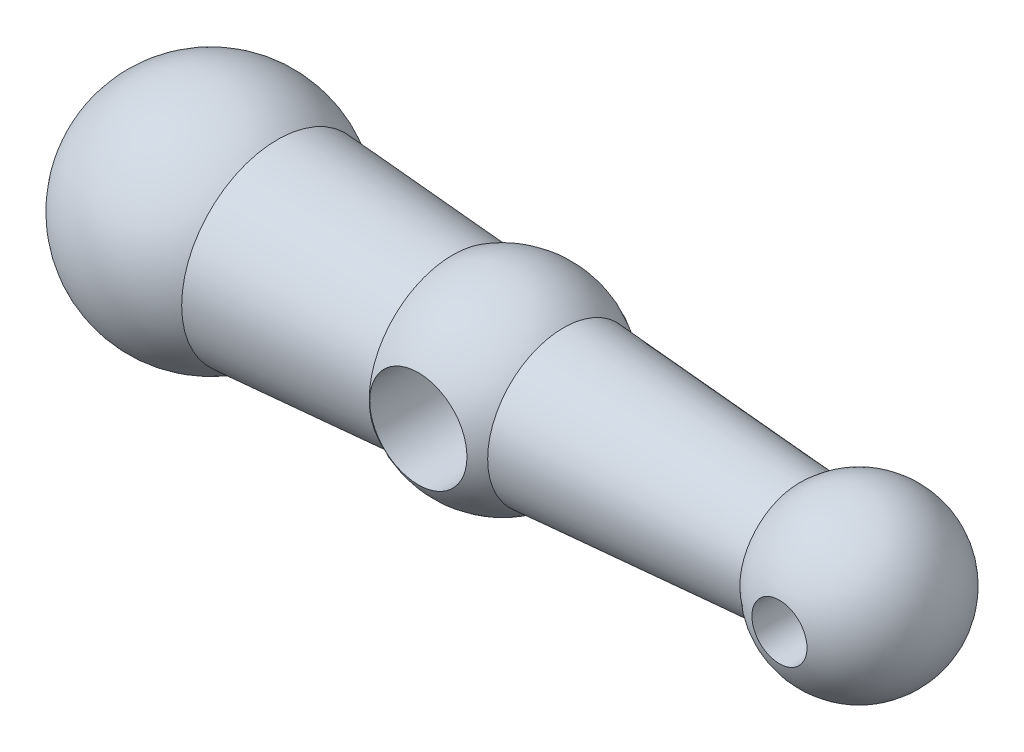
ISO-10303-21;
HEADER;
FILE_DESCRIPTION(('STEP AP214'),'2;1');
FILE_NAME('part.step','',(''),(''),'','','');
FILE_SCHEMA(('AUTOMOTIVE_DESIGN { 1 0 10303 214 1 1 1 1 }'));
ENDSEC;
DATA;
#1=APPLICATION_CONTEXT('core data for automotive mechanical design processes');
#2=APPLICATION_PROTOCOL_DEFINITION('international standard','automotive_design',2000,#1);
#3=PRODUCT_CONTEXT('',#1,'mechanical');
#4=PRODUCT('Part','Part','',(#3));
#5=PRODUCT_RELATED_PRODUCT_CATEGORY('part','',(#4));
#6=PRODUCT_DEFINITION_FORMATION('','',#4);
#7=PRODUCT_DEFINITION_CONTEXT('part definition',#1,'design');
#8=PRODUCT_DEFINITION('design','',#6,#7);
#9=PRODUCT_DEFINITION_SHAPE('','',#8);
#10=(LENGTH_UNIT() NAMED_UNIT(*) SI_UNIT(.MILLI.,.METRE.));
#11=(NAMED_UNIT(*) PLANE_ANGLE_UNIT() SI_UNIT($,.RADIAN.));
#12=(NAMED_UNIT(*) SI_UNIT($,.STERADIAN.) SOLID_ANGLE_UNIT());
#13=UNCERTAINTY_MEASURE_WITH_UNIT(LENGTH_MEASURE(1.E-05),#10,'distance_accuracy_value','');
#14=(GEOMETRIC_REPRESENTATION_CONTEXT(3) GLOBAL_UNCERTAINTY_ASSIGNED_CONTEXT((#13)) GLOBAL_UNIT_ASSIGNED_CONTEXT((#10,
#11,#12)) REPRESENTATION_CONTEXT('',''));
#15=CARTESIAN_POINT('',(0.,0.,0.));
#16=DIRECTION('',(0.,0.,1.));
#17=DIRECTION('',(1.,0.,0.));
#18=AXIS2_PLACEMENT_3D('',#15,#16,#17);
#19=CARTESIAN_POINT('',(50.,0.,0.));
#20=DIRECTION('',(-1.,0.,0.));
#21=DIRECTION('',(0.,0.,1.));
#22=AXIS2_PLACEMENT_3D('',#19,#20,#21);
#23=CONICAL_SURFACE('',#22,8.50365940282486,0.0698131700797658);
#24=CARTESIAN_POINT('',(4.39589792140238,0.,0.));
#25=DIRECTION('',(-1.,0.,0.));
#26=DIRECTION('',(0.,0.,1.));
#27=AXIS2_PLACEMENT_3D('',#24,#25,#26);
#28=CIRCLE('',#27,11.6926088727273);
#29=CARTESIAN_POINT('',(4.39589792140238,0.,11.6926088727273));
#30=VERTEX_POINT('',#29);
#31=EDGE_CURVE('E47',#30,#30,#28,.F.);
#32=ORIENTED_EDGE('',*,*,#31,.T.);
#33=EDGE_LOOP('',(#32));
#34=FACE_BOUND('',#33,.T.);
#35=CARTESIAN_POINT('',(40.7648662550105,0.,0.));
#36=DIRECTION('',(1.,0.,0.));
#37=DIRECTION('',(0.,0.,-1.));
#38=AXIS2_PLACEMENT_3D('',#35,#36,#37);
#39=CIRCLE('',#38,9.14944286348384);
#40=CARTESIAN_POINT('',(40.7648662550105,0.,-9.14944286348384));
#41=VERTEX_POINT('',#40);
#42=EDGE_CURVE('E11',#41,#41,#39,.T.);
#43=ORIENTED_EDGE('',*,*,#42,.F.);
#44=EDGE_LOOP('',(#43));
#45=FACE_BOUND('',#44,.T.);
#46=ADVANCED_FACE('F39',(#34,#45),#23,.T.);
#47=CARTESIAN_POINT('',(-5.,0.,0.));
#48=DIRECTION('',(0.,1.,0.));
#49=DIRECTION('',(1.,0.,0.));
#50=AXIS2_PLACEMENT_3D('',#47,#48,#49);
#51=SPHERICAL_SURFACE('',#50,15.);
#52=CARTESIAN_POINT('',(-5.,0.,12.9903810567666));
#53=DIRECTION('',(0.,0.,-1.));
#54=DIRECTION('',(-1.,0.,0.));
#55=AXIS2_PLACEMENT_3D('',#52,#53,#54);
#56=CIRCLE('',#55,7.5);
#57=CARTESIAN_POINT('',(-12.5,0.,12.9903810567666));
#58=VERTEX_POINT('',#57);
#59=EDGE_CURVE('E68',#58,#58,#56,.T.);
#60=ORIENTED_EDGE('',*,*,#59,.T.);
#61=EDGE_LOOP('',(#60));
#62=FACE_BOUND('',#61,.T.);
#63=CARTESIAN_POINT('',(-5.,0.,-12.9903810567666));
#64=DIRECTION('',(0.,0.,1.));
#65=DIRECTION('',(1.,0.,0.));
#66=AXIS2_PLACEMENT_3D('',#63,#64,#65);
#67=CIRCLE('',#66,7.5);
#68=CARTESIAN_POINT('',(2.5,0.,-12.9903810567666));
#69=VERTEX_POINT('',#68);
#70=EDGE_CURVE('E62',#69,#69,#67,.T.);
#71=ORIENTED_EDGE('',*,*,#70,.T.);
#72=EDGE_LOOP('',(#71));
#73=FACE_BOUND('',#72,.T.);
#74=CARTESIAN_POINT('',(-12.6771610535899,0.,0.));
#75=DIRECTION('',(1.,0.,0.));
#76=DIRECTION('',(0.,0.,-1.));
#77=AXIS2_PLACEMENT_3D('',#74,#75,#76);
#78=CIRCLE('',#77,12.8864734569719);
#79=CARTESIAN_POINT('',(-12.6771610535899,0.,-12.8864734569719));
#80=VERTEX_POINT('',#79);
#81=EDGE_CURVE('E67',#80,#80,#78,.T.);
#82=ORIENTED_EDGE('',*,*,#81,.T.);
#83=EDGE_LOOP('',(#82));
#84=FACE_BOUND('',#83,.T.);
#85=ORIENTED_EDGE('',*,*,#31,.F.);
#86=EDGE_LOOP('',(#85));
#87=FACE_BOUND('',#86,.T.);
#88=ADVANCED_FACE('F77',(#62,#73,#84,#87),#51,.T.);
#89=CARTESIAN_POINT('',(-5.,0.,0.));
#90=DIRECTION('',(-1.,0.,0.));
#91=DIRECTION('',(0.,0.,1.));
#92=AXIS2_PLACEMENT_3D('',#89,#90,#91);
#93=CONICAL_SURFACE('',#92,12.3496340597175,0.0698131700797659);
#94=CARTESIAN_POINT('',(-39.7228500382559,0.,0.));
#95=DIRECTION('',(-1.,0.,0.));
#96=DIRECTION('',(0.,0.,1.));
#97=AXIS2_PLACEMENT_3D('',#94,#95,#96);
#98=CIRCLE('',#97,14.7776922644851);
#99=CARTESIAN_POINT('',(-39.7228500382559,0.,14.7776922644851));
#100=VERTEX_POINT('',#99);
#101=EDGE_CURVE('E64',#100,#100,#98,.F.);
#102=ORIENTED_EDGE('',*,*,#101,.T.);
#103=EDGE_LOOP('',(#102));
#104=FACE_BOUND('',#103,.T.);
#105=ORIENTED_EDGE('',*,*,#81,.F.);
#106=EDGE_LOOP('',(#105));
#107=FACE_BOUND('',#106,.T.);
#108=ADVANCED_FACE('F99',(#104,#107),#93,.T.);
#109=CARTESIAN_POINT('',(-50.,0.,0.));
#110=DIRECTION('',(0.,1.,0.));
#111=DIRECTION('',(1.,0.,0.));
#112=AXIS2_PLACEMENT_3D('',#109,#110,#111);
#113=SPHERICAL_SURFACE('',#112,18.);
#114=CARTESIAN_POINT('',(-50.,0.,0.));
#115=DIRECTION('',(-1.,0.,0.));
#116=DIRECTION('',(0.,0.,1.));
#117=AXIS2_PLACEMENT_3D('',#114,#115,#116);
#118=SPHERICAL_SURFACE('',#117,18.);
#119=ORIENTED_EDGE('',*,*,#101,.F.);
#120=EDGE_LOOP('',(#119));
#121=FACE_BOUND('',#120,.T.);
#122=ADVANCED_FACE('F41',(#121),#118,.T.);
#123=CARTESIAN_POINT('',(50.,0.,0.));
#124=DIRECTION('',(0.,1.,0.));
#125=DIRECTION('',(1.,0.,0.));
#126=AXIS2_PLACEMENT_3D('',#123,#124,#125);
#127=SPHERICAL_SURFACE('',#126,13.);
#128=CARTESIAN_POINT('',(50.,0.,12.2856623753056));
#129=DIRECTION('',(0.,0.,-1.));
#130=DIRECTION('',(-1.,0.,0.));
#131=AXIS2_PLACEMENT_3D('',#128,#129,#130);
#132=CIRCLE('',#131,4.24999999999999);
#133=CARTESIAN_POINT('',(45.75,0.,12.2856623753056));
#134=VERTEX_POINT('',#133);
#135=EDGE_CURVE('E43',#134,#134,#132,.T.);
#136=ORIENTED_EDGE('',*,*,#135,.T.);
#137=EDGE_LOOP('',(#136));
#138=FACE_BOUND('',#137,.T.);
#139=ORIENTED_EDGE('',*,*,#42,.T.);
#140=EDGE_LOOP('',(#139));
#141=FACE_BOUND('',#140,.T.);
#142=ADVANCED_FACE('F82',(#138,#141),#127,.T.);
#143=CARTESIAN_POINT('',(-5.,0.,-150.));
#144=DIRECTION('',(0.,0.,1.));
#145=DIRECTION('',(1.,0.,0.));
#146=AXIS2_PLACEMENT_3D('',#143,#144,#145);
#147=CYLINDRICAL_SURFACE('',#146,7.5);
#148=ORIENTED_EDGE('',*,*,#70,.F.);
#149=EDGE_LOOP('',(#148));
#150=FACE_BOUND('',#149,.T.);
#151=ORIENTED_EDGE('',*,*,#59,.F.);
#152=EDGE_LOOP('',(#151));
#153=FACE_BOUND('',#152,.T.);
#154=ADVANCED_FACE('F80',(#150,#153),#147,.F.);
#155=CARTESIAN_POINT('',(50.,0.,13.));
#156=DIRECTION('',(0.,0.,1.));
#157=DIRECTION('',(1.,0.,0.));
#158=AXIS2_PLACEMENT_3D('',#155,#156,#157);
#159=CYLINDRICAL_SURFACE('',#158,4.24999999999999);
#160=CARTESIAN_POINT('',(50.,0.,3.));
#161=DIRECTION('',(0.,0.,1.));
#162=DIRECTION('',(1.,0.,0.));
#163=AXIS2_PLACEMENT_3D('',#160,#161,#162);
#164=CIRCLE('',#163,4.25);
#165=CARTESIAN_POINT('',(54.25,0.,3.));
#166=VERTEX_POINT('',#165);
#167=EDGE_CURVE('E58',#166,#166,#164,.T.);
#168=ORIENTED_EDGE('',*,*,#167,.F.);
#169=EDGE_LOOP('',(#168));
#170=FACE_BOUND('',#169,.T.);
#171=ORIENTED_EDGE('',*,*,#135,.F.);
#172=EDGE_LOOP('',(#171));
#173=FACE_BOUND('',#172,.T.);
#174=ADVANCED_FACE('F54',(#170,#173),#159,.F.);
#175=CARTESIAN_POINT('',(50.,0.,3.));
#176=DIRECTION('',(0.,0.,1.));
#177=DIRECTION('',(1.,0.,0.));
#178=AXIS2_PLACEMENT_3D('',#175,#176,#177);
#179=CONICAL_SURFACE('',#178,4.25,1.02974425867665);
#180=CARTESIAN_POINT('',(50.,0.,0.446342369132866));
#181=VERTEX_POINT('',#180);
#182=VERTEX_LOOP('',#181);
#183=FACE_BOUND('',#182,.T.);
#184=ORIENTED_EDGE('',*,*,#167,.T.);
#185=EDGE_LOOP('',(#184));
#186=FACE_BOUND('',#185,.T.);
#187=ADVANCED_FACE('F51',(#183,#186),#179,.F.);
#188=CLOSED_SHELL('',(#46,#88,#108,#122,#142,#154,#174,#187));
#189=MANIFOLD_SOLID_BREP('B2',#188);
#190=ADVANCED_BREP_SHAPE_REPRESENTATION('',(#18,#189),#14);
#191=SHAPE_DEFINITION_REPRESENTATION(#9,#190);
ENDSEC;
END-ISO-10303-21;
